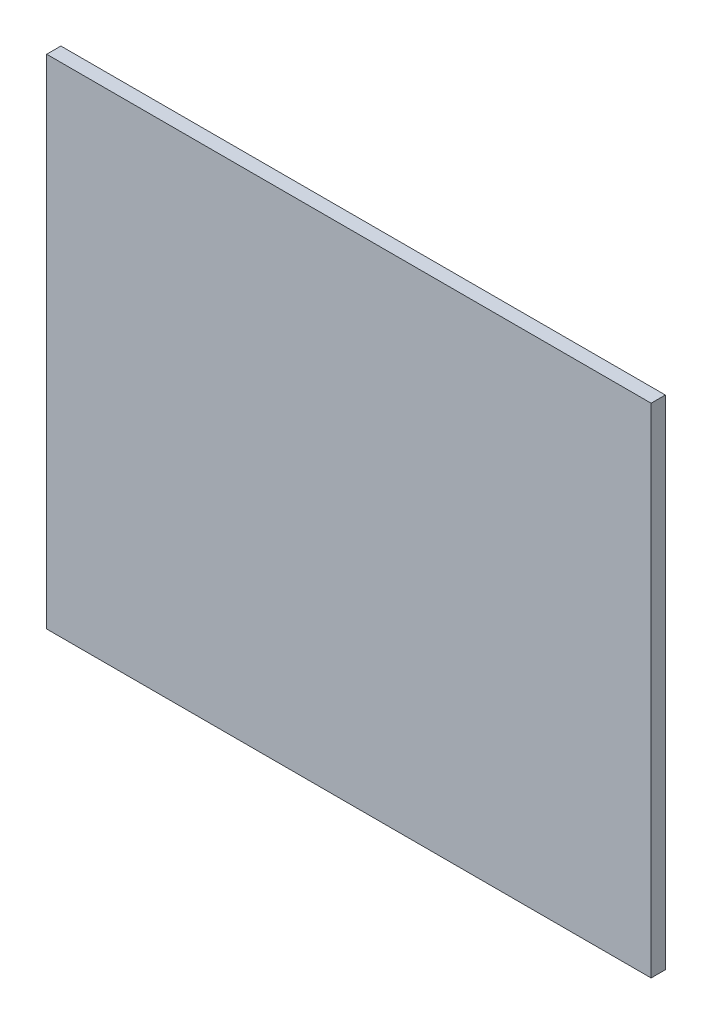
ISO-10303-21;
HEADER;
FILE_DESCRIPTION(('STEP AP214'),'2;1');
FILE_NAME('part.step','',(''),(''),'','','');
FILE_SCHEMA(('AUTOMOTIVE_DESIGN { 1 0 10303 214 1 1 1 1 }'));
ENDSEC;
DATA;
#1=APPLICATION_CONTEXT('core data for automotive mechanical design processes');
#2=APPLICATION_PROTOCOL_DEFINITION('international standard','automotive_design',2000,#1);
#3=PRODUCT_CONTEXT('',#1,'mechanical');
#4=PRODUCT('Part','Part','',(#3));
#5=PRODUCT_RELATED_PRODUCT_CATEGORY('part','',(#4));
#6=PRODUCT_DEFINITION_FORMATION('','',#4);
#7=PRODUCT_DEFINITION_CONTEXT('part definition',#1,'design');
#8=PRODUCT_DEFINITION('design','',#6,#7);
#9=PRODUCT_DEFINITION_SHAPE('','',#8);
#10=(LENGTH_UNIT() NAMED_UNIT(*) SI_UNIT(.MILLI.,.METRE.));
#11=(NAMED_UNIT(*) PLANE_ANGLE_UNIT() SI_UNIT($,.RADIAN.));
#12=(NAMED_UNIT(*) SI_UNIT($,.STERADIAN.) SOLID_ANGLE_UNIT());
#13=UNCERTAINTY_MEASURE_WITH_UNIT(LENGTH_MEASURE(1.E-05),#10,'distance_accuracy_value','');
#14=(GEOMETRIC_REPRESENTATION_CONTEXT(3) GLOBAL_UNCERTAINTY_ASSIGNED_CONTEXT((#13)) GLOBAL_UNIT_ASSIGNED_CONTEXT((#10,
#11,#12)) REPRESENTATION_CONTEXT('',''));
#15=CARTESIAN_POINT('',(0.,0.,0.));
#16=DIRECTION('',(0.,0.,1.));
#17=DIRECTION('',(1.,0.,0.));
#18=AXIS2_PLACEMENT_3D('',#15,#16,#17);
#19=CARTESIAN_POINT('',(810.,680.,0.));
#20=DIRECTION('',(0.,0.,1.));
#21=DIRECTION('',(1.,0.,0.));
#22=AXIS2_PLACEMENT_3D('',#19,#20,#21);
#23=PLANE('',#22);
#24=DIRECTION('',(0.,1.,0.));
#25=VECTOR('',#24,1.);
#26=CARTESIAN_POINT('',(1660.,1380.,0.));
#27=LINE('',#26,#25);
#28=CARTESIAN_POINT('',(1660.,-19.9999999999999,0.));
#29=VERTEX_POINT('',#28);
#30=CARTESIAN_POINT('',(1660.,1380.,0.));
#31=VERTEX_POINT('',#30);
#32=EDGE_CURVE('E18',#29,#31,#27,.T.);
#33=ORIENTED_EDGE('',*,*,#32,.F.);
#34=DIRECTION('',(1.,0.,0.));
#35=VECTOR('',#34,1.);
#36=CARTESIAN_POINT('',(1660.,-19.9999999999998,0.));
#37=LINE('',#36,#35);
#38=CARTESIAN_POINT('',(-40.0000000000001,-20.,0.));
#39=VERTEX_POINT('',#38);
#40=EDGE_CURVE('E78',#39,#29,#37,.T.);
#41=ORIENTED_EDGE('',*,*,#40,.F.);
#42=DIRECTION('',(0.,-1.,0.));
#43=VECTOR('',#42,1.);
#44=CARTESIAN_POINT('',(-40.,-20.,0.));
#45=LINE('',#44,#43);
#46=CARTESIAN_POINT('',(-40.0000000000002,1380.,0.));
#47=VERTEX_POINT('',#46);
#48=EDGE_CURVE('E66',#47,#39,#45,.T.);
#49=ORIENTED_EDGE('',*,*,#48,.F.);
#50=DIRECTION('',(1.,0.,0.));
#51=VECTOR('',#50,1.);
#52=CARTESIAN_POINT('',(-40.0000000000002,1380.,0.));
#53=LINE('',#52,#51);
#54=EDGE_CURVE('E53',#31,#47,#53,.F.);
#55=ORIENTED_EDGE('',*,*,#54,.F.);
#56=EDGE_LOOP('',(#33,#41,#49,#55));
#57=FACE_BOUND('',#56,.T.);
#58=ADVANCED_FACE('F15',(#57),#23,.F.);
#59=CARTESIAN_POINT('',(1660.,1380.,0.));
#60=DIRECTION('',(1.,0.,0.));
#61=DIRECTION('',(0.,0.,-1.));
#62=AXIS2_PLACEMENT_3D('',#59,#60,#61);
#63=PLANE('',#62);
#64=ORIENTED_EDGE('',*,*,#32,.T.);
#65=DIRECTION('',(0.,0.,1.));
#66=VECTOR('',#65,1.);
#67=CARTESIAN_POINT('',(1660.,1380.,0.));
#68=LINE('',#67,#66);
#69=CARTESIAN_POINT('',(1660.,1380.,40.));
#70=VERTEX_POINT('',#69);
#71=EDGE_CURVE('E59',#70,#31,#68,.F.);
#72=ORIENTED_EDGE('',*,*,#71,.F.);
#73=DIRECTION('',(0.,1.,0.));
#74=VECTOR('',#73,1.);
#75=CARTESIAN_POINT('',(1660.,680.,40.));
#76=LINE('',#75,#74);
#77=CARTESIAN_POINT('',(1660.,-19.9999999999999,40.));
#78=VERTEX_POINT('',#77);
#79=EDGE_CURVE('E81',#78,#70,#76,.T.);
#80=ORIENTED_EDGE('',*,*,#79,.F.);
#81=DIRECTION('',(0.,0.,1.));
#82=VECTOR('',#81,1.);
#83=CARTESIAN_POINT('',(1660.,-19.9999999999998,0.));
#84=LINE('',#83,#82);
#85=EDGE_CURVE('E62',#29,#78,#84,.T.);
#86=ORIENTED_EDGE('',*,*,#85,.F.);
#87=EDGE_LOOP('',(#64,#72,#80,#86));
#88=FACE_BOUND('',#87,.T.);
#89=ADVANCED_FACE('F58',(#88),#63,.T.);
#90=CARTESIAN_POINT('',(-40.0000000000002,1380.,0.));
#91=DIRECTION('',(0.,1.,0.));
#92=DIRECTION('',(0.,0.,1.));
#93=AXIS2_PLACEMENT_3D('',#90,#91,#92);
#94=PLANE('',#93);
#95=ORIENTED_EDGE('',*,*,#54,.T.);
#96=DIRECTION('',(0.,0.,1.));
#97=VECTOR('',#96,1.);
#98=CARTESIAN_POINT('',(-40.0000000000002,1380.,0.));
#99=LINE('',#98,#97);
#100=CARTESIAN_POINT('',(-40.0000000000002,1380.,40.));
#101=VERTEX_POINT('',#100);
#102=EDGE_CURVE('E68',#101,#47,#99,.F.);
#103=ORIENTED_EDGE('',*,*,#102,.F.);
#104=DIRECTION('',(1.,0.,0.));
#105=VECTOR('',#104,1.);
#106=CARTESIAN_POINT('',(810.,1380.,40.));
#107=LINE('',#106,#105);
#108=EDGE_CURVE('E72',#70,#101,#107,.F.);
#109=ORIENTED_EDGE('',*,*,#108,.F.);
#110=ORIENTED_EDGE('',*,*,#71,.T.);
#111=EDGE_LOOP('',(#95,#103,#109,#110));
#112=FACE_BOUND('',#111,.T.);
#113=ADVANCED_FACE('F70',(#112),#94,.T.);
#114=CARTESIAN_POINT('',(-40.,-20.,0.));
#115=DIRECTION('',(-1.,0.,0.));
#116=DIRECTION('',(0.,-1.,0.));
#117=AXIS2_PLACEMENT_3D('',#114,#115,#116);
#118=PLANE('',#117);
#119=ORIENTED_EDGE('',*,*,#48,.T.);
#120=DIRECTION('',(0.,0.,1.));
#121=VECTOR('',#120,1.);
#122=CARTESIAN_POINT('',(-40.,-20.,0.));
#123=LINE('',#122,#121);
#124=CARTESIAN_POINT('',(-40.0000000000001,-20.,40.));
#125=VERTEX_POINT('',#124);
#126=EDGE_CURVE('E33',#125,#39,#123,.F.);
#127=ORIENTED_EDGE('',*,*,#126,.F.);
#128=DIRECTION('',(0.,1.,0.));
#129=VECTOR('',#128,1.);
#130=CARTESIAN_POINT('',(-40.0000000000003,680.,40.));
#131=LINE('',#130,#129);
#132=EDGE_CURVE('E24',#101,#125,#131,.F.);
#133=ORIENTED_EDGE('',*,*,#132,.F.);
#134=ORIENTED_EDGE('',*,*,#102,.T.);
#135=EDGE_LOOP('',(#119,#127,#133,#134));
#136=FACE_BOUND('',#135,.T.);
#137=ADVANCED_FACE('F87',(#136),#118,.T.);
#138=CARTESIAN_POINT('',(1660.,-19.9999999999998,0.));
#139=DIRECTION('',(0.,-1.,0.));
#140=DIRECTION('',(1.,0.,0.));
#141=AXIS2_PLACEMENT_3D('',#138,#139,#140);
#142=PLANE('',#141);
#143=ORIENTED_EDGE('',*,*,#40,.T.);
#144=ORIENTED_EDGE('',*,*,#85,.T.);
#145=DIRECTION('',(1.,0.,0.));
#146=VECTOR('',#145,1.);
#147=CARTESIAN_POINT('',(810.,-20.,40.));
#148=LINE('',#147,#146);
#149=EDGE_CURVE('E9',#125,#78,#148,.T.);
#150=ORIENTED_EDGE('',*,*,#149,.F.);
#151=ORIENTED_EDGE('',*,*,#126,.T.);
#152=EDGE_LOOP('',(#143,#144,#150,#151));
#153=FACE_BOUND('',#152,.T.);
#154=ADVANCED_FACE('F89',(#153),#142,.T.);
#155=CARTESIAN_POINT('',(810.,680.,40.));
#156=DIRECTION('',(0.,0.,1.));
#157=DIRECTION('',(1.,0.,0.));
#158=AXIS2_PLACEMENT_3D('',#155,#156,#157);
#159=PLANE('',#158);
#160=ORIENTED_EDGE('',*,*,#132,.T.);
#161=ORIENTED_EDGE('',*,*,#149,.T.);
#162=ORIENTED_EDGE('',*,*,#79,.T.);
#163=ORIENTED_EDGE('',*,*,#108,.T.);
#164=EDGE_LOOP('',(#160,#161,#162,#163));
#165=FACE_BOUND('',#164,.T.);
#166=ADVANCED_FACE('F86',(#165),#159,.T.);
#167=CLOSED_SHELL('',(#58,#89,#113,#137,#154,#166));
#168=MANIFOLD_SOLID_BREP('B1',#167);
#169=ADVANCED_BREP_SHAPE_REPRESENTATION('',(#18,#168),#14);
#170=SHAPE_DEFINITION_REPRESENTATION(#9,#169);
ENDSEC;
END-ISO-10303-21;
